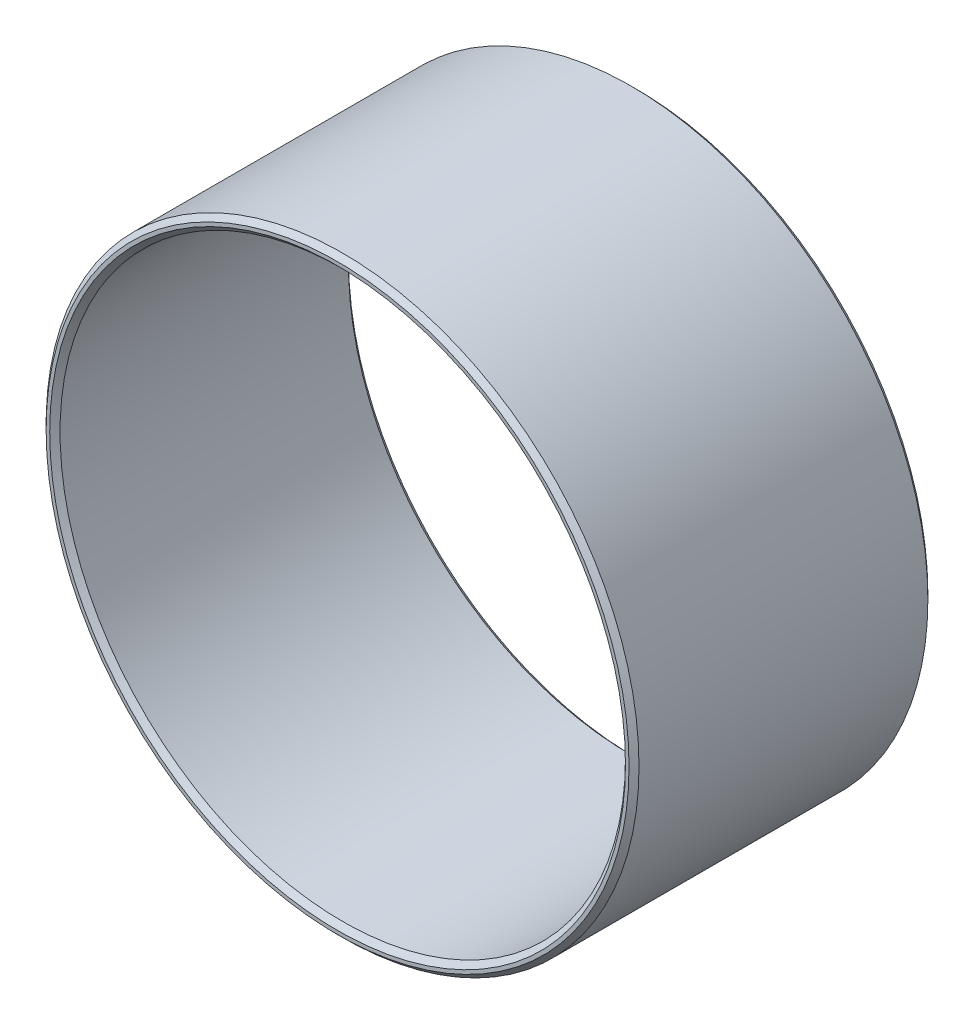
ISO-10303-21;
HEADER;
FILE_DESCRIPTION(('STEP AP214'),'2;1');
FILE_NAME('part.step','',(''),(''),'','','');
FILE_SCHEMA(('AUTOMOTIVE_DESIGN { 1 0 10303 214 1 1 1 1 }'));
ENDSEC;
DATA;
#1=APPLICATION_CONTEXT('core data for automotive mechanical design processes');
#2=APPLICATION_PROTOCOL_DEFINITION('international standard','automotive_design',2000,#1);
#3=PRODUCT_CONTEXT('',#1,'mechanical');
#4=PRODUCT('Part','Part','',(#3));
#5=PRODUCT_RELATED_PRODUCT_CATEGORY('part','',(#4));
#6=PRODUCT_DEFINITION_FORMATION('','',#4);
#7=PRODUCT_DEFINITION_CONTEXT('part definition',#1,'design');
#8=PRODUCT_DEFINITION('design','',#6,#7);
#9=PRODUCT_DEFINITION_SHAPE('','',#8);
#10=(LENGTH_UNIT() NAMED_UNIT(*) SI_UNIT(.MILLI.,.METRE.));
#11=(NAMED_UNIT(*) PLANE_ANGLE_UNIT() SI_UNIT($,.RADIAN.));
#12=(NAMED_UNIT(*) SI_UNIT($,.STERADIAN.) SOLID_ANGLE_UNIT());
#13=UNCERTAINTY_MEASURE_WITH_UNIT(LENGTH_MEASURE(1.E-05),#10,'distance_accuracy_value','');
#14=(GEOMETRIC_REPRESENTATION_CONTEXT(3) GLOBAL_UNCERTAINTY_ASSIGNED_CONTEXT((#13)) GLOBAL_UNIT_ASSIGNED_CONTEXT((#10,
#11,#12)) REPRESENTATION_CONTEXT('',''));
#15=CARTESIAN_POINT('',(0.,0.,0.));
#16=DIRECTION('',(0.,0.,1.));
#17=DIRECTION('',(1.,0.,0.));
#18=AXIS2_PLACEMENT_3D('',#15,#16,#17);
#19=CARTESIAN_POINT('',(0.,0.,190.5));
#20=DIRECTION('',(0.,0.,1.));
#21=DIRECTION('',(1.,0.,0.));
#22=AXIS2_PLACEMENT_3D('',#19,#20,#21);
#23=PLANE('',#22);
#24=CARTESIAN_POINT('',(0.,0.,190.5));
#25=DIRECTION('',(0.,0.,1.));
#26=DIRECTION('',(1.,0.,0.));
#27=AXIS2_PLACEMENT_3D('',#24,#25,#26);
#28=CIRCLE('',#27,183.515);
#29=CARTESIAN_POINT('',(183.515,0.,190.5));
#30=VERTEX_POINT('',#29);
#31=EDGE_CURVE('E10',#30,#30,#28,.F.);
#32=ORIENTED_EDGE('',*,*,#31,.T.);
#33=EDGE_LOOP('',(#32));
#34=FACE_BOUND('',#33,.T.);
#35=CARTESIAN_POINT('',(0.,0.,190.5));
#36=DIRECTION('',(0.,0.,1.));
#37=DIRECTION('',(1.,0.,0.));
#38=AXIS2_PLACEMENT_3D('',#35,#36,#37);
#39=CIRCLE('',#38,185.801);
#40=CARTESIAN_POINT('',(185.801,0.,190.5));
#41=VERTEX_POINT('',#40);
#42=EDGE_CURVE('E399',#41,#41,#39,.T.);
#43=ORIENTED_EDGE('',*,*,#42,.T.);
#44=EDGE_LOOP('',(#43));
#45=FACE_BOUND('',#44,.T.);
#46=ADVANCED_FACE('F379',(#34,#45),#23,.T.);
#47=CARTESIAN_POINT('',(0.,0.,0.));
#48=DIRECTION('',(0.,0.,1.));
#49=DIRECTION('',(1.,0.,0.));
#50=AXIS2_PLACEMENT_3D('',#47,#48,#49);
#51=PLANE('',#50);
#52=CARTESIAN_POINT('',(0.,0.,0.));
#53=DIRECTION('',(0.,0.,1.));
#54=DIRECTION('',(1.,0.,0.));
#55=AXIS2_PLACEMENT_3D('',#52,#53,#54);
#56=CIRCLE('',#55,183.515);
#57=CARTESIAN_POINT('',(183.515,0.,0.));
#58=VERTEX_POINT('',#57);
#59=EDGE_CURVE('E394',#58,#58,#56,.T.);
#60=ORIENTED_EDGE('',*,*,#59,.T.);
#61=EDGE_LOOP('',(#60));
#62=FACE_BOUND('',#61,.T.);
#63=CARTESIAN_POINT('',(0.,0.,0.));
#64=DIRECTION('',(0.,0.,1.));
#65=DIRECTION('',(1.,0.,0.));
#66=AXIS2_PLACEMENT_3D('',#63,#64,#65);
#67=CIRCLE('',#66,185.801);
#68=CARTESIAN_POINT('',(185.801,0.,0.));
#69=VERTEX_POINT('',#68);
#70=EDGE_CURVE('E402',#69,#69,#67,.F.);
#71=ORIENTED_EDGE('',*,*,#70,.T.);
#72=EDGE_LOOP('',(#71));
#73=FACE_BOUND('',#72,.T.);
#74=ADVANCED_FACE('F422',(#62,#73),#51,.F.);
#75=CARTESIAN_POINT('',(0.,0.,190.5));
#76=DIRECTION('',(0.,0.,-1.));
#77=DIRECTION('',(-1.,0.,0.));
#78=AXIS2_PLACEMENT_3D('',#75,#76,#77);
#79=CYLINDRICAL_SURFACE('',#78,188.976);
#80=CARTESIAN_POINT('',(0.,0.,3.17499999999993));
#81=DIRECTION('',(0.,0.,1.));
#82=DIRECTION('',(1.,0.,0.));
#83=AXIS2_PLACEMENT_3D('',#80,#81,#82);
#84=CIRCLE('',#83,188.976);
#85=CARTESIAN_POINT('',(188.976,0.,3.17499999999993));
#86=VERTEX_POINT('',#85);
#87=EDGE_CURVE('E405',#86,#86,#84,.T.);
#88=ORIENTED_EDGE('',*,*,#87,.T.);
#89=EDGE_LOOP('',(#88));
#90=FACE_BOUND('',#89,.T.);
#91=CARTESIAN_POINT('',(0.,0.,187.325));
#92=DIRECTION('',(0.,0.,1.));
#93=DIRECTION('',(1.,0.,0.));
#94=AXIS2_PLACEMENT_3D('',#91,#92,#93);
#95=CIRCLE('',#94,188.976);
#96=CARTESIAN_POINT('',(188.976,0.,187.325));
#97=VERTEX_POINT('',#96);
#98=EDGE_CURVE('E408',#97,#97,#95,.F.);
#99=ORIENTED_EDGE('',*,*,#98,.T.);
#100=EDGE_LOOP('',(#99));
#101=FACE_BOUND('',#100,.T.);
#102=ADVANCED_FACE('F381',(#90,#101),#79,.T.);
#103=CARTESIAN_POINT('',(0.,0.,190.5));
#104=DIRECTION('',(0.,0.,-1.));
#105=DIRECTION('',(-1.,0.,0.));
#106=AXIS2_PLACEMENT_3D('',#103,#104,#105);
#107=CYLINDRICAL_SURFACE('',#106,180.213);
#108=CARTESIAN_POINT('',(0.,0.,3.30199999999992));
#109=DIRECTION('',(0.,0.,1.));
#110=DIRECTION('',(1.,0.,0.));
#111=AXIS2_PLACEMENT_3D('',#108,#109,#110);
#112=CIRCLE('',#111,180.213);
#113=CARTESIAN_POINT('',(180.213,0.,3.30199999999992));
#114=VERTEX_POINT('',#113);
#115=EDGE_CURVE('E386',#114,#114,#112,.F.);
#116=ORIENTED_EDGE('',*,*,#115,.T.);
#117=EDGE_LOOP('',(#116));
#118=FACE_BOUND('',#117,.T.);
#119=CARTESIAN_POINT('',(0.,0.,187.198));
#120=DIRECTION('',(0.,0.,1.));
#121=DIRECTION('',(1.,0.,0.));
#122=AXIS2_PLACEMENT_3D('',#119,#120,#121);
#123=CIRCLE('',#122,180.213);
#124=CARTESIAN_POINT('',(180.213,0.,187.198));
#125=VERTEX_POINT('',#124);
#126=EDGE_CURVE('E390',#125,#125,#123,.T.);
#127=ORIENTED_EDGE('',*,*,#126,.T.);
#128=EDGE_LOOP('',(#127));
#129=FACE_BOUND('',#128,.T.);
#130=ADVANCED_FACE('F429',(#118,#129),#107,.F.);
#131=CARTESIAN_POINT('',(0.,0.,3.17499999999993));
#132=DIRECTION('',(0.,0.,1.));
#133=DIRECTION('',(1.,0.,0.));
#134=AXIS2_PLACEMENT_3D('',#131,#132,#133);
#135=CONICAL_SURFACE('',#134,188.976,0.785398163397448);
#136=ORIENTED_EDGE('',*,*,#70,.F.);
#137=EDGE_LOOP('',(#136));
#138=FACE_BOUND('',#137,.T.);
#139=ORIENTED_EDGE('',*,*,#87,.F.);
#140=EDGE_LOOP('',(#139));
#141=FACE_BOUND('',#140,.T.);
#142=ADVANCED_FACE('F417',(#138,#141),#135,.T.);
#143=CARTESIAN_POINT('',(0.,0.,190.5));
#144=DIRECTION('',(0.,0.,-1.));
#145=DIRECTION('',(-1.,0.,0.));
#146=AXIS2_PLACEMENT_3D('',#143,#144,#145);
#147=CONICAL_SURFACE('',#146,185.801,0.785398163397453);
#148=ORIENTED_EDGE('',*,*,#98,.F.);
#149=EDGE_LOOP('',(#148));
#150=FACE_BOUND('',#149,.T.);
#151=ORIENTED_EDGE('',*,*,#42,.F.);
#152=EDGE_LOOP('',(#151));
#153=FACE_BOUND('',#152,.T.);
#154=ADVANCED_FACE('F413',(#150,#153),#147,.T.);
#155=CARTESIAN_POINT('',(0.,0.,0.));
#156=DIRECTION('',(0.,0.,-1.));
#157=DIRECTION('',(-1.,0.,0.));
#158=AXIS2_PLACEMENT_3D('',#155,#156,#157);
#159=CONICAL_SURFACE('',#158,183.515,0.785398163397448);
#160=ORIENTED_EDGE('',*,*,#115,.F.);
#161=EDGE_LOOP('',(#160));
#162=FACE_BOUND('',#161,.T.);
#163=ORIENTED_EDGE('',*,*,#59,.F.);
#164=EDGE_LOOP('',(#163));
#165=FACE_BOUND('',#164,.T.);
#166=ADVANCED_FACE('F416',(#162,#165),#159,.F.);
#167=CARTESIAN_POINT('',(0.,0.,187.198));
#168=DIRECTION('',(0.,0.,1.));
#169=DIRECTION('',(1.,0.,0.));
#170=AXIS2_PLACEMENT_3D('',#167,#168,#169);
#171=CONICAL_SURFACE('',#170,180.213,0.785398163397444);
#172=CARTESIAN_POINT('',(183.515,0.,190.5));
#173=CARTESIAN_POINT('',(183.480604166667,0.,190.465604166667));
#174=CARTESIAN_POINT('',(183.446208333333,0.,190.431208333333));
#175=CARTESIAN_POINT('',(183.377416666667,0.,190.362416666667));
#176=CARTESIAN_POINT('',(183.343020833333,0.,190.328020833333));
#177=CARTESIAN_POINT('',(183.274229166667,0.,190.259229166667));
#178=CARTESIAN_POINT('',(183.239833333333,0.,190.224833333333));
#179=CARTESIAN_POINT('',(183.171041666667,0.,190.156041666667));
#180=CARTESIAN_POINT('',(183.136645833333,0.,190.121645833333));
#181=CARTESIAN_POINT('',(183.067854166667,0.,190.052854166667));
#182=CARTESIAN_POINT('',(183.033458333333,0.,190.018458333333));
#183=CARTESIAN_POINT('',(182.964666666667,0.,189.949666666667));
#184=CARTESIAN_POINT('',(182.930270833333,0.,189.915270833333));
#185=CARTESIAN_POINT('',(182.861479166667,0.,189.846479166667));
#186=CARTESIAN_POINT('',(182.827083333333,0.,189.812083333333));
#187=CARTESIAN_POINT('',(182.758291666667,0.,189.743291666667));
#188=CARTESIAN_POINT('',(182.723895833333,0.,189.708895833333));
#189=CARTESIAN_POINT('',(182.655104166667,0.,189.640104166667));
#190=CARTESIAN_POINT('',(182.620708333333,0.,189.605708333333));
#191=CARTESIAN_POINT('',(182.551916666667,0.,189.536916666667));
#192=CARTESIAN_POINT('',(182.517520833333,0.,189.502520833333));
#193=CARTESIAN_POINT('',(182.448729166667,0.,189.433729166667));
#194=CARTESIAN_POINT('',(182.414333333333,0.,189.399333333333));
#195=CARTESIAN_POINT('',(182.345541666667,0.,189.330541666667));
#196=CARTESIAN_POINT('',(182.311145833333,0.,189.296145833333));
#197=CARTESIAN_POINT('',(182.242354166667,0.,189.227354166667));
#198=CARTESIAN_POINT('',(182.207958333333,0.,189.192958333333));
#199=CARTESIAN_POINT('',(182.139166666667,0.,189.124166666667));
#200=CARTESIAN_POINT('',(182.104770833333,0.,189.089770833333));
#201=CARTESIAN_POINT('',(182.035979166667,0.,189.020979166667));
#202=CARTESIAN_POINT('',(182.001583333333,0.,188.986583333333));
#203=CARTESIAN_POINT('',(181.932791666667,0.,188.917791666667));
#204=CARTESIAN_POINT('',(181.898395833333,0.,188.883395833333));
#205=CARTESIAN_POINT('',(181.829604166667,0.,188.814604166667));
#206=CARTESIAN_POINT('',(181.795208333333,0.,188.780208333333));
#207=CARTESIAN_POINT('',(181.726416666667,0.,188.711416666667));
#208=CARTESIAN_POINT('',(181.692020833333,0.,188.677020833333));
#209=CARTESIAN_POINT('',(181.623229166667,0.,188.608229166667));
#210=CARTESIAN_POINT('',(181.588833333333,0.,188.573833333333));
#211=CARTESIAN_POINT('',(181.520041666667,0.,188.505041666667));
#212=CARTESIAN_POINT('',(181.485645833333,0.,188.470645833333));
#213=CARTESIAN_POINT('',(181.416854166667,0.,188.401854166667));
#214=CARTESIAN_POINT('',(181.382458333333,0.,188.367458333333));
#215=CARTESIAN_POINT('',(181.313666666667,0.,188.298666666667));
#216=CARTESIAN_POINT('',(181.279270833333,0.,188.264270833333));
#217=CARTESIAN_POINT('',(181.210479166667,0.,188.195479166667));
#218=CARTESIAN_POINT('',(181.176083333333,0.,188.161083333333));
#219=CARTESIAN_POINT('',(181.107291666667,0.,188.092291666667));
#220=CARTESIAN_POINT('',(181.072895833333,0.,188.057895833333));
#221=CARTESIAN_POINT('',(181.004104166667,0.,187.989104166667));
#222=CARTESIAN_POINT('',(180.969708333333,0.,187.954708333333));
#223=CARTESIAN_POINT('',(180.900916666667,0.,187.885916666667));
#224=CARTESIAN_POINT('',(180.866520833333,0.,187.851520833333));
#225=CARTESIAN_POINT('',(180.797729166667,0.,187.782729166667));
#226=CARTESIAN_POINT('',(180.763333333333,0.,187.748333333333));
#227=CARTESIAN_POINT('',(180.694541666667,0.,187.679541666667));
#228=CARTESIAN_POINT('',(180.660145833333,0.,187.645145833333));
#229=CARTESIAN_POINT('',(180.591354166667,0.,187.576354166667));
#230=CARTESIAN_POINT('',(180.556958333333,0.,187.541958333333));
#231=CARTESIAN_POINT('',(180.488166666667,0.,187.473166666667));
#232=CARTESIAN_POINT('',(180.453770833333,0.,187.438770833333));
#233=CARTESIAN_POINT('',(180.384979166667,0.,187.369979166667));
#234=CARTESIAN_POINT('',(180.350583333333,0.,187.335583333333));
#235=CARTESIAN_POINT('',(180.281791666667,0.,187.266791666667));
#236=CARTESIAN_POINT('',(180.247395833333,0.,187.232395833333));
#237=CARTESIAN_POINT('',(180.213,0.,187.198));
#238=B_SPLINE_CURVE_WITH_KNOTS('',3,(#172,#173,#174,#175,#176,#177,#178,#179,#180,#181,#182,
#183,#184,#185,#186,#187,#188,#189,#190,#191,#192,#193,#194,#195,#196,#197,#198,#199,#200,#201,
#202,#203,#204,#205,#206,#207,#208,#209,#210,#211,#212,#213,#214,#215,#216,#217,#218,#219,#220,
#221,#222,#223,#224,#225,#226,#227,#228,#229,#230,#231,#232,#233,#234,#235,#236,#237),
.UNSPECIFIED.,.F.,.F.,(4,2,2,2,2,2,2,2,2,2,2,2,2,2,2,2,2,2,2,2,2,2,2,2,2,2,2,2,2,2,2,2,4),(0.,
0.14592916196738,0.29185832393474,0.4377874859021,0.58371664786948,0.72964580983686,
0.87557497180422,1.02150413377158,1.16743329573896,1.31336245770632,1.4592916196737,
1.60522078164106,1.75114994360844,1.8970791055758,2.04300826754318,2.18893742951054,
2.33486659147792,2.48079575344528,2.62672491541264,2.77265407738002,2.9185832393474,
3.06451240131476,3.21044156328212,3.3563707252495,3.50229988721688,3.64822904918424,
3.7941582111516,3.94008737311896,4.08601653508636,4.23194569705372,4.37787485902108,
4.52380402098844,4.6697331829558),.UNSPECIFIED.);
#239=EDGE_CURVE('BSEAM437',#30,#125,#238,.T.);
#240=ORIENTED_EDGE('',*,*,#31,.F.);
#241=ORIENTED_EDGE('',*,*,#126,.F.);
#242=ORIENTED_EDGE('',*,*,#239,.T.);
#243=ORIENTED_EDGE('',*,*,#239,.F.);
#244=EDGE_LOOP('',(#240,#242,#241,#243));
#245=FACE_BOUND('',#244,.T.);
#246=ADVANCED_FACE('F437',(#245),#171,.F.);
#247=CLOSED_SHELL('',(#46,#74,#102,#130,#142,#154,#166,#246));
#248=MANIFOLD_SOLID_BREP('B2',#247);
#249=ADVANCED_BREP_SHAPE_REPRESENTATION('',(#18,#248),#14);
#250=SHAPE_DEFINITION_REPRESENTATION(#9,#249);
ENDSEC;
END-ISO-10303-21;
